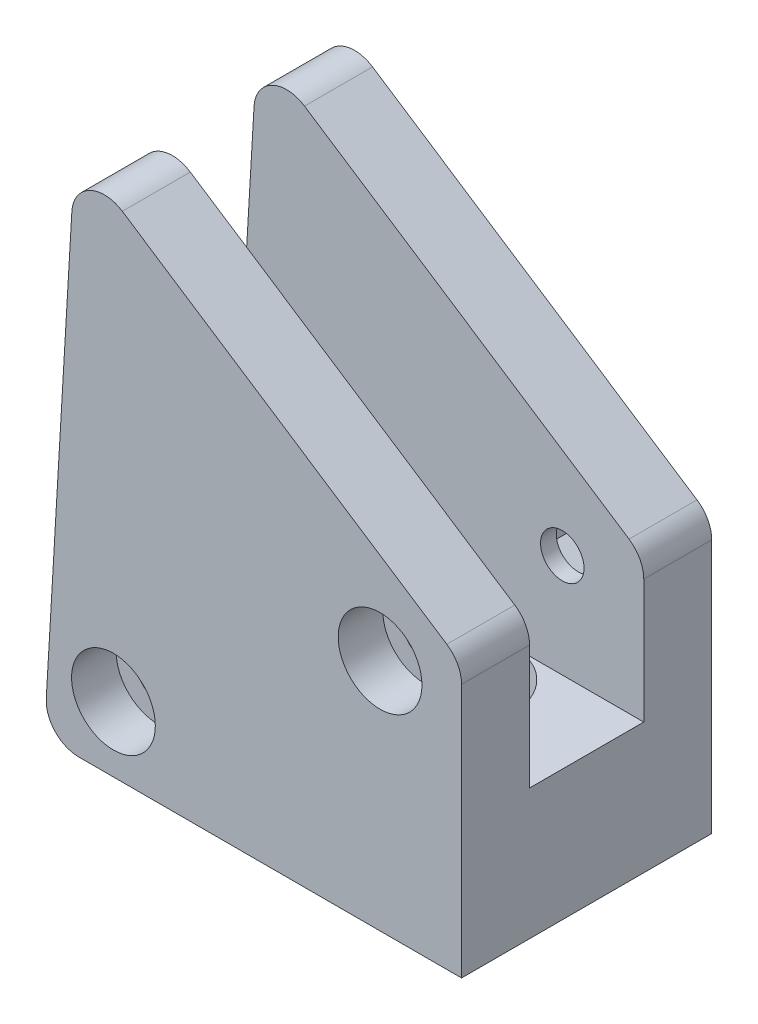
ISO-10303-21;
HEADER;
FILE_DESCRIPTION(('STEP AP214'),'2;1');
FILE_NAME('part.step','',(''),(''),'','','');
FILE_SCHEMA(('AUTOMOTIVE_DESIGN { 1 0 10303 214 1 1 1 1 }'));
ENDSEC;
DATA;
#1=APPLICATION_CONTEXT('core data for automotive mechanical design processes');
#2=APPLICATION_PROTOCOL_DEFINITION('international standard','automotive_design',2000,#1);
#3=PRODUCT_CONTEXT('',#1,'mechanical');
#4=PRODUCT('Part','Part','',(#3));
#5=PRODUCT_RELATED_PRODUCT_CATEGORY('part','',(#4));
#6=PRODUCT_DEFINITION_FORMATION('','',#4);
#7=PRODUCT_DEFINITION_CONTEXT('part definition',#1,'design');
#8=PRODUCT_DEFINITION('design','',#6,#7);
#9=PRODUCT_DEFINITION_SHAPE('','',#8);
#10=(LENGTH_UNIT() NAMED_UNIT(*) SI_UNIT(.MILLI.,.METRE.));
#11=(NAMED_UNIT(*) PLANE_ANGLE_UNIT() SI_UNIT($,.RADIAN.));
#12=(NAMED_UNIT(*) SI_UNIT($,.STERADIAN.) SOLID_ANGLE_UNIT());
#13=UNCERTAINTY_MEASURE_WITH_UNIT(LENGTH_MEASURE(1.E-05),#10,'distance_accuracy_value','');
#14=(GEOMETRIC_REPRESENTATION_CONTEXT(3) GLOBAL_UNCERTAINTY_ASSIGNED_CONTEXT((#13)) GLOBAL_UNIT_ASSIGNED_CONTEXT((#10,
#11,#12)) REPRESENTATION_CONTEXT('',''));
#15=CARTESIAN_POINT('',(0.,0.,0.));
#16=DIRECTION('',(0.,0.,1.));
#17=DIRECTION('',(1.,0.,0.));
#18=AXIS2_PLACEMENT_3D('',#15,#16,#17);
#19=CARTESIAN_POINT('',(-32.,6.,11.5));
#20=DIRECTION('',(0.,0.,-1.));
#21=DIRECTION('',(-1.,0.,0.));
#22=AXIS2_PLACEMENT_3D('',#19,#20,#21);
#23=CYLINDRICAL_SURFACE('',#22,2.);
#24=CARTESIAN_POINT('',(-32.,6.,-5.25));
#25=DIRECTION('',(0.,0.,1.));
#26=DIRECTION('',(1.,0.,0.));
#27=AXIS2_PLACEMENT_3D('',#24,#25,#26);
#28=CIRCLE('',#27,2.);
#29=CARTESIAN_POINT('',(-30.,6.,-5.25));
#30=VERTEX_POINT('',#29);
#31=EDGE_CURVE('E471',#30,#30,#28,.T.);
#32=ORIENTED_EDGE('',*,*,#31,.T.);
#33=EDGE_LOOP('',(#32));
#34=FACE_BOUND('',#33,.T.);
#35=CARTESIAN_POINT('',(-32.,6.,-6.7));
#36=DIRECTION('',(0.,0.,-1.));
#37=DIRECTION('',(-1.,0.,0.));
#38=AXIS2_PLACEMENT_3D('',#35,#36,#37);
#39=CIRCLE('',#38,2.);
#40=CARTESIAN_POINT('',(-34.,6.,-6.7));
#41=VERTEX_POINT('',#40);
#42=EDGE_CURVE('E44',#41,#41,#39,.T.);
#43=ORIENTED_EDGE('',*,*,#42,.T.);
#44=EDGE_LOOP('',(#43));
#45=FACE_BOUND('',#44,.T.);
#46=ADVANCED_FACE('F40',(#34,#45),#23,.F.);
#47=CARTESIAN_POINT('',(-7.48979804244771,21.5,11.5));
#48=DIRECTION('',(0.,0.,-1.));
#49=DIRECTION('',(-1.,0.,0.));
#50=AXIS2_PLACEMENT_3D('',#47,#48,#49);
#51=CYLINDRICAL_SURFACE('',#50,2.);
#52=CARTESIAN_POINT('',(-7.48979804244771,21.5,-5.25));
#53=DIRECTION('',(0.,0.,1.));
#54=DIRECTION('',(1.,0.,0.));
#55=AXIS2_PLACEMENT_3D('',#52,#53,#54);
#56=CIRCLE('',#55,2.);
#57=CARTESIAN_POINT('',(-5.48979804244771,21.5,-5.25));
#58=VERTEX_POINT('',#57);
#59=EDGE_CURVE('E470',#58,#58,#56,.T.);
#60=ORIENTED_EDGE('',*,*,#59,.T.);
#61=EDGE_LOOP('',(#60));
#62=FACE_BOUND('',#61,.T.);
#63=CARTESIAN_POINT('',(-7.48979804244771,21.5,-6.7));
#64=DIRECTION('',(0.,0.,-1.));
#65=DIRECTION('',(-1.,0.,0.));
#66=AXIS2_PLACEMENT_3D('',#63,#64,#65);
#67=CIRCLE('',#66,2.);
#68=CARTESIAN_POINT('',(-9.48979804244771,21.5,-6.7));
#69=VERTEX_POINT('',#68);
#70=EDGE_CURVE('E301',#69,#69,#67,.T.);
#71=ORIENTED_EDGE('',*,*,#70,.T.);
#72=EDGE_LOOP('',(#71));
#73=FACE_BOUND('',#72,.T.);
#74=ADVANCED_FACE('F710',(#62,#73),#51,.F.);
#75=CARTESIAN_POINT('',(-32.,6.,5.25));
#76=DIRECTION('',(0.,0.,1.));
#77=DIRECTION('',(1.,0.,0.));
#78=AXIS2_PLACEMENT_3D('',#75,#76,#77);
#79=CIRCLE('',#78,2.);
#80=CARTESIAN_POINT('',(-30.,6.,5.25));
#81=VERTEX_POINT('',#80);
#82=EDGE_CURVE('E439',#81,#81,#79,.T.);
#83=ORIENTED_EDGE('',*,*,#82,.F.);
#84=EDGE_LOOP('',(#83));
#85=FACE_BOUND('',#84,.T.);
#86=CARTESIAN_POINT('',(-32.,6.,7.4));
#87=DIRECTION('',(0.,0.,1.));
#88=DIRECTION('',(1.,0.,0.));
#89=AXIS2_PLACEMENT_3D('',#86,#87,#88);
#90=CIRCLE('',#89,2.);
#91=CARTESIAN_POINT('',(-30.,6.,7.4));
#92=VERTEX_POINT('',#91);
#93=EDGE_CURVE('E398',#92,#92,#90,.T.);
#94=ORIENTED_EDGE('',*,*,#93,.T.);
#95=EDGE_LOOP('',(#94));
#96=FACE_BOUND('',#95,.T.);
#97=ADVANCED_FACE('F713',(#85,#96),#23,.F.);
#98=CARTESIAN_POINT('',(-7.48979804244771,21.5,5.25));
#99=DIRECTION('',(0.,0.,1.));
#100=DIRECTION('',(1.,0.,0.));
#101=AXIS2_PLACEMENT_3D('',#98,#99,#100);
#102=CIRCLE('',#101,2.);
#103=CARTESIAN_POINT('',(-5.48979804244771,21.5,5.25));
#104=VERTEX_POINT('',#103);
#105=EDGE_CURVE('E428',#104,#104,#102,.T.);
#106=ORIENTED_EDGE('',*,*,#105,.F.);
#107=EDGE_LOOP('',(#106));
#108=FACE_BOUND('',#107,.T.);
#109=CARTESIAN_POINT('',(-7.48979804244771,21.5,7.4));
#110=DIRECTION('',(0.,0.,1.));
#111=DIRECTION('',(1.,0.,0.));
#112=AXIS2_PLACEMENT_3D('',#109,#110,#111);
#113=CIRCLE('',#112,2.);
#114=CARTESIAN_POINT('',(-5.48979804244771,21.5,7.4));
#115=VERTEX_POINT('',#114);
#116=EDGE_CURVE('E380',#115,#115,#113,.T.);
#117=ORIENTED_EDGE('',*,*,#116,.T.);
#118=EDGE_LOOP('',(#117));
#119=FACE_BOUND('',#118,.T.);
#120=ADVANCED_FACE('F719',(#108,#119),#51,.F.);
#121=CARTESIAN_POINT('',(0.,12.,-5.25));
#122=DIRECTION('',(0.,1.,0.));
#123=DIRECTION('',(-1.,0.,0.));
#124=AXIS2_PLACEMENT_3D('',#121,#122,#123);
#125=PLANE('',#124);
#126=CARTESIAN_POINT('',(-12.,12.,0.));
#127=DIRECTION('',(0.,1.,0.));
#128=DIRECTION('',(-1.,0.,0.));
#129=AXIS2_PLACEMENT_3D('',#126,#127,#128);
#130=CIRCLE('',#129,5.25);
#131=CARTESIAN_POINT('',(-12.,12.,5.25));
#132=VERTEX_POINT('',#131);
#133=CARTESIAN_POINT('',(-12.,12.,-5.25));
#134=VERTEX_POINT('',#133);
#135=EDGE_CURVE('E12',#132,#134,#130,.T.);
#136=ORIENTED_EDGE('',*,*,#135,.F.);
#137=DIRECTION('',(-1.,0.,0.));
#138=VECTOR('',#137,1.);
#139=CARTESIAN_POINT('',(0.,12.,5.25));
#140=LINE('',#139,#138);
#141=CARTESIAN_POINT('',(0.,12.,5.25));
#142=VERTEX_POINT('',#141);
#143=EDGE_CURVE('E413',#142,#132,#140,.T.);
#144=ORIENTED_EDGE('',*,*,#143,.F.);
#145=DIRECTION('',(0.,0.,1.));
#146=VECTOR('',#145,1.);
#147=CARTESIAN_POINT('',(0.,12.,-5.25));
#148=LINE('',#147,#146);
#149=CARTESIAN_POINT('',(0.,12.,-5.25));
#150=VERTEX_POINT('',#149);
#151=EDGE_CURVE('E412',#150,#142,#148,.T.);
#152=ORIENTED_EDGE('',*,*,#151,.F.);
#153=DIRECTION('',(-1.,0.,0.));
#154=VECTOR('',#153,1.);
#155=CARTESIAN_POINT('',(0.,12.,-5.25));
#156=LINE('',#155,#154);
#157=EDGE_CURVE('E399',#150,#134,#156,.T.);
#158=ORIENTED_EDGE('',*,*,#157,.T.);
#159=EDGE_LOOP('',(#136,#144,#152,#158));
#160=FACE_BOUND('',#159,.T.);
#161=ADVANCED_FACE('F726',(#160),#125,.T.);
#162=CARTESIAN_POINT('',(0.,0.,11.5));
#163=DIRECTION('',(-1.,0.,0.));
#164=DIRECTION('',(0.,0.,1.));
#165=AXIS2_PLACEMENT_3D('',#162,#163,#164);
#166=PLANE('',#165);
#167=DIRECTION('',(0.,0.,-1.));
#168=VECTOR('',#167,1.);
#169=CARTESIAN_POINT('',(0.,0.,11.5));
#170=LINE('',#169,#168);
#171=CARTESIAN_POINT('',(0.,0.,11.5));
#172=VERTEX_POINT('',#171);
#173=CARTESIAN_POINT('',(0.,0.,-11.5));
#174=VERTEX_POINT('',#173);
#175=EDGE_CURVE('E576',#172,#174,#170,.T.);
#176=ORIENTED_EDGE('',*,*,#175,.T.);
#177=DIRECTION('',(0.,1.,0.));
#178=VECTOR('',#177,1.);
#179=CARTESIAN_POINT('',(0.,0.,-11.5));
#180=LINE('',#179,#178);
#181=CARTESIAN_POINT('',(0.,23.3795369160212,-11.5));
#182=VERTEX_POINT('',#181);
#183=EDGE_CURVE('E524',#174,#182,#180,.T.);
#184=ORIENTED_EDGE('',*,*,#183,.T.);
#185=DIRECTION('',(0.,0.,-1.));
#186=VECTOR('',#185,1.);
#187=CARTESIAN_POINT('',(0.,23.3795369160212,11.5));
#188=LINE('',#187,#186);
#189=CARTESIAN_POINT('',(0.,23.3795369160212,-5.25));
#190=VERTEX_POINT('',#189);
#191=EDGE_CURVE('E571',#190,#182,#188,.T.);
#192=ORIENTED_EDGE('',*,*,#191,.F.);
#193=DIRECTION('',(0.,1.,0.));
#194=VECTOR('',#193,1.);
#195=CARTESIAN_POINT('',(0.,0.,-5.25));
#196=LINE('',#195,#194);
#197=EDGE_CURVE('E490',#150,#190,#196,.T.);
#198=ORIENTED_EDGE('',*,*,#197,.F.);
#199=ORIENTED_EDGE('',*,*,#151,.T.);
#200=DIRECTION('',(0.,1.,0.));
#201=VECTOR('',#200,1.);
#202=CARTESIAN_POINT('',(0.,0.,5.25));
#203=LINE('',#202,#201);
#204=CARTESIAN_POINT('',(0.,23.3795369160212,5.25));
#205=VERTEX_POINT('',#204);
#206=EDGE_CURVE('E462',#142,#205,#203,.T.);
#207=ORIENTED_EDGE('',*,*,#206,.T.);
#208=CARTESIAN_POINT('',(0.,23.3795369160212,11.5));
#209=VERTEX_POINT('',#208);
#210=EDGE_CURVE('E572',#209,#205,#188,.T.);
#211=ORIENTED_EDGE('',*,*,#210,.F.);
#212=DIRECTION('',(0.,1.,0.));
#213=VECTOR('',#212,1.);
#214=CARTESIAN_POINT('',(0.,0.,11.5));
#215=LINE('',#214,#213);
#216=EDGE_CURVE('E501',#172,#209,#215,.T.);
#217=ORIENTED_EDGE('',*,*,#216,.F.);
#218=EDGE_LOOP('',(#176,#184,#192,#198,#199,#207,#211,#217));
#219=FACE_BOUND('',#218,.T.);
#220=ADVANCED_FACE('F673',(#219),#166,.F.);
#221=CARTESIAN_POINT('',(-3.,23.3795369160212,11.5));
#222=DIRECTION('',(0.,0.,-1.));
#223=DIRECTION('',(-1.,0.,0.));
#224=AXIS2_PLACEMENT_3D('',#221,#222,#223);
#225=CYLINDRICAL_SURFACE('',#224,3.);
#226=CARTESIAN_POINT('',(-3.,23.3795369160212,-5.25));
#227=DIRECTION('',(0.,0.,1.));
#228=DIRECTION('',(1.,0.,0.));
#229=AXIS2_PLACEMENT_3D('',#226,#227,#228);
#230=CIRCLE('',#229,3.);
#231=CARTESIAN_POINT('',(-1.35519854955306,25.8884466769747,-5.25));
#232=VERTEX_POINT('',#231);
#233=EDGE_CURVE('E487',#190,#232,#230,.T.);
#234=ORIENTED_EDGE('',*,*,#233,.F.);
#235=ORIENTED_EDGE('',*,*,#191,.T.);
#236=CARTESIAN_POINT('',(-3.,23.3795369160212,-11.5));
#237=DIRECTION('',(0.,0.,1.));
#238=DIRECTION('',(1.,0.,0.));
#239=AXIS2_PLACEMENT_3D('',#236,#237,#238);
#240=CIRCLE('',#239,3.);
#241=CARTESIAN_POINT('',(-1.35519854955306,25.8884466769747,-11.5));
#242=VERTEX_POINT('',#241);
#243=EDGE_CURVE('E528',#182,#242,#240,.T.);
#244=ORIENTED_EDGE('',*,*,#243,.T.);
#245=DIRECTION('',(0.,0.,-1.));
#246=VECTOR('',#245,1.);
#247=CARTESIAN_POINT('',(-1.35519854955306,25.8884466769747,11.5));
#248=LINE('',#247,#246);
#249=EDGE_CURVE('E566',#232,#242,#248,.T.);
#250=ORIENTED_EDGE('',*,*,#249,.F.);
#251=EDGE_LOOP('',(#234,#235,#244,#250));
#252=FACE_BOUND('',#251,.T.);
#253=ADVANCED_FACE('F668',(#252),#225,.T.);
#254=CARTESIAN_POINT('',(-1.35519854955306,25.8884466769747,11.5));
#255=DIRECTION('',(-0.548267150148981,-0.836303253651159,0.));
#256=DIRECTION('',(0.836303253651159,-0.548267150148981,0.));
#257=AXIS2_PLACEMENT_3D('',#254,#255,#256);
#258=PLANE('',#257);
#259=DIRECTION('',(-0.836303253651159,0.548267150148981,0.));
#260=VECTOR('',#259,1.);
#261=CARTESIAN_POINT('',(-1.35519854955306,25.8884466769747,-5.25));
#262=LINE('',#261,#260);
#263=CARTESIAN_POINT('',(-31.1839969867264,45.4437338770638,-5.25));
#264=VERTEX_POINT('',#263);
#265=EDGE_CURVE('E484',#232,#264,#262,.T.);
#266=ORIENTED_EDGE('',*,*,#265,.F.);
#267=ORIENTED_EDGE('',*,*,#249,.T.);
#268=DIRECTION('',(-0.836303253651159,0.548267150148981,0.));
#269=VECTOR('',#268,1.);
#270=CARTESIAN_POINT('',(-1.35519854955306,25.8884466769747,-11.5));
#271=LINE('',#270,#269);
#272=CARTESIAN_POINT('',(-31.1839969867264,45.4437338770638,-11.5));
#273=VERTEX_POINT('',#272);
#274=EDGE_CURVE('E532',#242,#273,#271,.T.);
#275=ORIENTED_EDGE('',*,*,#274,.T.);
#276=DIRECTION('',(0.,0.,-1.));
#277=VECTOR('',#276,1.);
#278=CARTESIAN_POINT('',(-31.1839969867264,45.4437338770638,11.5));
#279=LINE('',#278,#277);
#280=EDGE_CURVE('E561',#264,#273,#279,.T.);
#281=ORIENTED_EDGE('',*,*,#280,.F.);
#282=EDGE_LOOP('',(#266,#267,#275,#281));
#283=FACE_BOUND('',#282,.T.);
#284=ADVANCED_FACE('F663',(#283),#258,.F.);
#285=CARTESIAN_POINT('',(-32.8287984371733,42.9348241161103,11.5));
#286=DIRECTION('',(0.,0.,-1.));
#287=DIRECTION('',(-1.,0.,0.));
#288=AXIS2_PLACEMENT_3D('',#285,#286,#287);
#289=CYLINDRICAL_SURFACE('',#288,3.);
#290=CARTESIAN_POINT('',(-32.8287984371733,42.9348241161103,-5.25));
#291=DIRECTION('',(0.,0.,1.));
#292=DIRECTION('',(1.,0.,0.));
#293=AXIS2_PLACEMENT_3D('',#290,#291,#292);
#294=CIRCLE('',#293,3.);
#295=CARTESIAN_POINT('',(-35.8236036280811,43.1112947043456,-5.25));
#296=VERTEX_POINT('',#295);
#297=EDGE_CURVE('E481',#264,#296,#294,.T.);
#298=ORIENTED_EDGE('',*,*,#297,.F.);
#299=ORIENTED_EDGE('',*,*,#280,.T.);
#300=CARTESIAN_POINT('',(-32.8287984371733,42.9348241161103,-11.5));
#301=DIRECTION('',(0.,0.,1.));
#302=DIRECTION('',(1.,0.,0.));
#303=AXIS2_PLACEMENT_3D('',#300,#301,#302);
#304=CIRCLE('',#303,3.);
#305=CARTESIAN_POINT('',(-35.8236036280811,43.1112947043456,-11.5));
#306=VERTEX_POINT('',#305);
#307=EDGE_CURVE('E536',#273,#306,#304,.T.);
#308=ORIENTED_EDGE('',*,*,#307,.T.);
#309=DIRECTION('',(0.,0.,-1.));
#310=VECTOR('',#309,1.);
#311=CARTESIAN_POINT('',(-35.8236036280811,43.1112947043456,11.5));
#312=LINE('',#311,#310);
#313=EDGE_CURVE('E556',#296,#306,#312,.T.);
#314=ORIENTED_EDGE('',*,*,#313,.F.);
#315=EDGE_LOOP('',(#298,#299,#308,#314));
#316=FACE_BOUND('',#315,.T.);
#317=ADVANCED_FACE('F658',(#316),#289,.T.);
#318=CARTESIAN_POINT('',(-35.8236036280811,43.1112947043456,11.5));
#319=DIRECTION('',(0.998268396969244,-0.0588235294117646,0.));
#320=DIRECTION('',(0.0588235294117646,0.998268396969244,0.));
#321=AXIS2_PLACEMENT_3D('',#318,#319,#320);
#322=PLANE('',#321);
#323=DIRECTION('',(-0.0588235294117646,-0.998268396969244,0.));
#324=VECTOR('',#323,1.);
#325=CARTESIAN_POINT('',(-35.8236036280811,43.1112947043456,-5.25));
#326=LINE('',#325,#324);
#327=CARTESIAN_POINT('',(-38.1767857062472,3.1764705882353,-5.25));
#328=VERTEX_POINT('',#327);
#329=EDGE_CURVE('E478',#296,#328,#326,.T.);
#330=ORIENTED_EDGE('',*,*,#329,.F.);
#331=ORIENTED_EDGE('',*,*,#313,.T.);
#332=DIRECTION('',(-0.0588235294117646,-0.998268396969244,0.));
#333=VECTOR('',#332,1.);
#334=CARTESIAN_POINT('',(-35.8236036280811,43.1112947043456,-11.5));
#335=LINE('',#334,#333);
#336=CARTESIAN_POINT('',(-38.1767857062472,3.1764705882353,-11.5));
#337=VERTEX_POINT('',#336);
#338=EDGE_CURVE('E540',#306,#337,#335,.T.);
#339=ORIENTED_EDGE('',*,*,#338,.T.);
#340=DIRECTION('',(0.,0.,-1.));
#341=VECTOR('',#340,1.);
#342=CARTESIAN_POINT('',(-38.1767857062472,3.1764705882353,11.5));
#343=LINE('',#342,#341);
#344=EDGE_CURVE('E551',#328,#337,#343,.T.);
#345=ORIENTED_EDGE('',*,*,#344,.F.);
#346=EDGE_LOOP('',(#330,#331,#339,#345));
#347=FACE_BOUND('',#346,.T.);
#348=ADVANCED_FACE('F652',(#347),#322,.F.);
#349=CARTESIAN_POINT('',(-35.1819805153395,3.,11.5));
#350=DIRECTION('',(0.,0.,-1.));
#351=DIRECTION('',(-1.,0.,0.));
#352=AXIS2_PLACEMENT_3D('',#349,#350,#351);
#353=CYLINDRICAL_SURFACE('',#352,3.);
#354=CARTESIAN_POINT('',(-35.1819805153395,3.,-5.25));
#355=DIRECTION('',(0.,0.,1.));
#356=DIRECTION('',(1.,0.,0.));
#357=AXIS2_PLACEMENT_3D('',#354,#355,#356);
#358=CIRCLE('',#357,3.);
#359=CARTESIAN_POINT('',(-35.1819805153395,0.,-5.25));
#360=VERTEX_POINT('',#359);
#361=EDGE_CURVE('E475',#328,#360,#358,.T.);
#362=ORIENTED_EDGE('',*,*,#361,.F.);
#363=ORIENTED_EDGE('',*,*,#344,.T.);
#364=CARTESIAN_POINT('',(-35.1819805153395,3.,-11.5));
#365=DIRECTION('',(0.,0.,1.));
#366=DIRECTION('',(1.,0.,0.));
#367=AXIS2_PLACEMENT_3D('',#364,#365,#366);
#368=CIRCLE('',#367,3.);
#369=CARTESIAN_POINT('',(-35.1819805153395,0.,-11.5));
#370=VERTEX_POINT('',#369);
#371=EDGE_CURVE('E502',#337,#370,#368,.T.);
#372=ORIENTED_EDGE('',*,*,#371,.T.);
#373=DIRECTION('',(0.,0.,-1.));
#374=VECTOR('',#373,1.);
#375=CARTESIAN_POINT('',(-35.1819805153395,0.,11.5));
#376=LINE('',#375,#374);
#377=EDGE_CURVE('E520',#360,#370,#376,.T.);
#378=ORIENTED_EDGE('',*,*,#377,.F.);
#379=EDGE_LOOP('',(#362,#363,#372,#378));
#380=FACE_BOUND('',#379,.T.);
#381=ADVANCED_FACE('F647',(#380),#353,.T.);
#382=CARTESIAN_POINT('',(-3.,23.3795369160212,11.5));
#383=DIRECTION('',(0.,0.,1.));
#384=DIRECTION('',(1.,0.,0.));
#385=AXIS2_PLACEMENT_3D('',#382,#383,#384);
#386=PLANE('',#385);
#387=CARTESIAN_POINT('',(-32.,6.,11.5));
#388=DIRECTION('',(0.,0.,1.));
#389=DIRECTION('',(1.,0.,0.));
#390=AXIS2_PLACEMENT_3D('',#387,#388,#389);
#391=CIRCLE('',#390,3.85);
#392=CARTESIAN_POINT('',(-28.15,6.,11.5));
#393=VERTEX_POINT('',#392);
#394=EDGE_CURVE('E381',#393,#393,#391,.T.);
#395=ORIENTED_EDGE('',*,*,#394,.F.);
#396=EDGE_LOOP('',(#395));
#397=FACE_BOUND('',#396,.T.);
#398=CARTESIAN_POINT('',(-7.48979804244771,21.5,11.5));
#399=DIRECTION('',(0.,0.,1.));
#400=DIRECTION('',(1.,0.,0.));
#401=AXIS2_PLACEMENT_3D('',#398,#399,#400);
#402=CIRCLE('',#401,3.85);
#403=CARTESIAN_POINT('',(-3.63979804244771,21.5,11.5));
#404=VERTEX_POINT('',#403);
#405=EDGE_CURVE('E389',#404,#404,#402,.T.);
#406=ORIENTED_EDGE('',*,*,#405,.F.);
#407=EDGE_LOOP('',(#406));
#408=FACE_BOUND('',#407,.T.);
#409=DIRECTION('',(1.,0.,0.));
#410=VECTOR('',#409,1.);
#411=CARTESIAN_POINT('',(-35.1819805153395,0.,11.5));
#412=LINE('',#411,#410);
#413=CARTESIAN_POINT('',(-35.1819805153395,0.,11.5));
#414=VERTEX_POINT('',#413);
#415=EDGE_CURVE('E497',#414,#172,#412,.T.);
#416=ORIENTED_EDGE('',*,*,#415,.T.);
#417=ORIENTED_EDGE('',*,*,#216,.T.);
#418=CARTESIAN_POINT('',(-3.,23.3795369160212,11.5));
#419=DIRECTION('',(0.,0.,1.));
#420=DIRECTION('',(1.,0.,0.));
#421=AXIS2_PLACEMENT_3D('',#418,#419,#420);
#422=CIRCLE('',#421,3.);
#423=CARTESIAN_POINT('',(-1.35519854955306,25.8884466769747,11.5));
#424=VERTEX_POINT('',#423);
#425=EDGE_CURVE('E505',#209,#424,#422,.T.);
#426=ORIENTED_EDGE('',*,*,#425,.T.);
#427=DIRECTION('',(-0.836303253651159,0.548267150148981,0.));
#428=VECTOR('',#427,1.);
#429=CARTESIAN_POINT('',(-1.35519854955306,25.8884466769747,11.5));
#430=LINE('',#429,#428);
#431=CARTESIAN_POINT('',(-31.1839969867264,45.4437338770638,11.5));
#432=VERTEX_POINT('',#431);
#433=EDGE_CURVE('E508',#424,#432,#430,.T.);
#434=ORIENTED_EDGE('',*,*,#433,.T.);
#435=CARTESIAN_POINT('',(-32.8287984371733,42.9348241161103,11.5));
#436=DIRECTION('',(0.,0.,1.));
#437=DIRECTION('',(1.,0.,0.));
#438=AXIS2_PLACEMENT_3D('',#435,#436,#437);
#439=CIRCLE('',#438,3.);
#440=CARTESIAN_POINT('',(-35.8236036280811,43.1112947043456,11.5));
#441=VERTEX_POINT('',#440);
#442=EDGE_CURVE('E511',#432,#441,#439,.T.);
#443=ORIENTED_EDGE('',*,*,#442,.T.);
#444=DIRECTION('',(-0.0588235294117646,-0.998268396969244,0.));
#445=VECTOR('',#444,1.);
#446=CARTESIAN_POINT('',(-35.8236036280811,43.1112947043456,11.5));
#447=LINE('',#446,#445);
#448=CARTESIAN_POINT('',(-38.1767857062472,3.1764705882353,11.5));
#449=VERTEX_POINT('',#448);
#450=EDGE_CURVE('E514',#441,#449,#447,.T.);
#451=ORIENTED_EDGE('',*,*,#450,.T.);
#452=CARTESIAN_POINT('',(-35.1819805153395,3.,11.5));
#453=DIRECTION('',(0.,0.,1.));
#454=DIRECTION('',(1.,0.,0.));
#455=AXIS2_PLACEMENT_3D('',#452,#453,#454);
#456=CIRCLE('',#455,3.);
#457=EDGE_CURVE('E517',#449,#414,#456,.T.);
#458=ORIENTED_EDGE('',*,*,#457,.T.);
#459=EDGE_LOOP('',(#416,#417,#426,#434,#443,#451,#458));
#460=FACE_BOUND('',#459,.T.);
#461=ADVANCED_FACE('F630',(#397,#408,#460),#386,.T.);
#462=CARTESIAN_POINT('',(-3.,23.3795369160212,-11.5));
#463=DIRECTION('',(0.,0.,1.));
#464=DIRECTION('',(1.,0.,0.));
#465=AXIS2_PLACEMENT_3D('',#462,#463,#464);
#466=PLANE('',#465);
#467=DIRECTION('',(0.868272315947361,-0.496087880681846,0.));
#468=VECTOR('',#467,1.);
#469=CARTESIAN_POINT('',(-7.50959366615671,25.8878173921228,-11.5));
#470=LINE('',#469,#468);
#471=CARTESIAN_POINT('',(-7.50959366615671,25.8878173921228,-11.5));
#472=VERTEX_POINT('',#471);
#473=CARTESIAN_POINT('',(-3.69973452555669,23.7110522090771,-11.5));
#474=VERTEX_POINT('',#473);
#475=EDGE_CURVE('E283',#472,#474,#470,.T.);
#476=ORIENTED_EDGE('',*,*,#475,.F.);
#477=DIRECTION('',(0.863760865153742,0.503901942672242,0.));
#478=VECTOR('',#477,1.);
#479=CARTESIAN_POINT('',(-11.2996571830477,23.6767651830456,-11.5));
#480=LINE('',#479,#478);
#481=CARTESIAN_POINT('',(-11.2996571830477,23.6767651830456,-11.5));
#482=VERTEX_POINT('',#481);
#483=EDGE_CURVE('E58',#482,#472,#480,.T.);
#484=ORIENTED_EDGE('',*,*,#483,.F.);
#485=DIRECTION('',(-0.00451145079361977,0.999989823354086,0.));
#486=VECTOR('',#485,1.);
#487=CARTESIAN_POINT('',(-11.2798615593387,19.2889477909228,-11.5));
#488=LINE('',#487,#486);
#489=CARTESIAN_POINT('',(-11.2798615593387,19.2889477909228,-11.5));
#490=VERTEX_POINT('',#489);
#491=EDGE_CURVE('E263',#490,#482,#488,.T.);
#492=ORIENTED_EDGE('',*,*,#491,.F.);
#493=DIRECTION('',(-0.868272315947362,0.496087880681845,0.));
#494=VECTOR('',#493,1.);
#495=CARTESIAN_POINT('',(-7.47000241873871,17.1121826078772,-11.5));
#496=LINE('',#495,#494);
#497=CARTESIAN_POINT('',(-7.47000241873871,17.1121826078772,-11.5));
#498=VERTEX_POINT('',#497);
#499=EDGE_CURVE('E267',#498,#490,#496,.T.);
#500=ORIENTED_EDGE('',*,*,#499,.F.);
#501=DIRECTION('',(-0.863760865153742,-0.503901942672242,0.));
#502=VECTOR('',#501,1.);
#503=CARTESIAN_POINT('',(-3.67993890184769,19.3232348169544,-11.5));
#504=LINE('',#503,#502);
#505=CARTESIAN_POINT('',(-3.67993890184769,19.3232348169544,-11.5));
#506=VERTEX_POINT('',#505);
#507=EDGE_CURVE('E291',#506,#498,#504,.T.);
#508=ORIENTED_EDGE('',*,*,#507,.F.);
#509=DIRECTION('',(0.00451145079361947,-0.999989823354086,0.));
#510=VECTOR('',#509,1.);
#511=CARTESIAN_POINT('',(-3.69973452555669,23.7110522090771,-11.5));
#512=LINE('',#511,#510);
#513=EDGE_CURVE('E287',#474,#506,#512,.T.);
#514=ORIENTED_EDGE('',*,*,#513,.F.);
#515=EDGE_LOOP('',(#476,#484,#492,#500,#508,#514));
#516=FACE_BOUND('',#515,.T.);
#517=DIRECTION('',(0.866025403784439,-0.499999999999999,0.));
#518=VECTOR('',#517,1.);
#519=CARTESIAN_POINT('',(-32.,10.3878620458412,-11.5));
#520=LINE('',#519,#518);
#521=CARTESIAN_POINT('',(-32.,10.3878620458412,-11.5));
#522=VERTEX_POINT('',#521);
#523=CARTESIAN_POINT('',(-28.2,8.19393102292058,-11.5));
#524=VERTEX_POINT('',#523);
#525=EDGE_CURVE('E341',#522,#524,#520,.T.);
#526=ORIENTED_EDGE('',*,*,#525,.F.);
#527=DIRECTION('',(0.866025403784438,0.500000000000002,0.));
#528=VECTOR('',#527,1.);
#529=CARTESIAN_POINT('',(-35.8,8.19393102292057,-11.5));
#530=LINE('',#529,#528);
#531=CARTESIAN_POINT('',(-35.8,8.19393102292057,-11.5));
#532=VERTEX_POINT('',#531);
#533=EDGE_CURVE('E66',#532,#522,#530,.T.);
#534=ORIENTED_EDGE('',*,*,#533,.F.);
#535=DIRECTION('',(0.,1.,0.));
#536=VECTOR('',#535,1.);
#537=CARTESIAN_POINT('',(-35.8,3.80606897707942,-11.5));
#538=LINE('',#537,#536);
#539=CARTESIAN_POINT('',(-35.8,3.80606897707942,-11.5));
#540=VERTEX_POINT('',#539);
#541=EDGE_CURVE('E318',#540,#532,#538,.T.);
#542=ORIENTED_EDGE('',*,*,#541,.F.);
#543=DIRECTION('',(-0.866025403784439,0.5,0.));
#544=VECTOR('',#543,1.);
#545=CARTESIAN_POINT('',(-32.,1.61213795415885,-11.5));
#546=LINE('',#545,#544);
#547=CARTESIAN_POINT('',(-32.,1.61213795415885,-11.5));
#548=VERTEX_POINT('',#547);
#549=EDGE_CURVE('E353',#548,#540,#546,.T.);
#550=ORIENTED_EDGE('',*,*,#549,.F.);
#551=DIRECTION('',(-0.866025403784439,-0.5,0.));
#552=VECTOR('',#551,1.);
#553=CARTESIAN_POINT('',(-28.2,3.80606897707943,-11.5));
#554=LINE('',#553,#552);
#555=CARTESIAN_POINT('',(-28.2,3.80606897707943,-11.5));
#556=VERTEX_POINT('',#555);
#557=EDGE_CURVE('E349',#556,#548,#554,.T.);
#558=ORIENTED_EDGE('',*,*,#557,.F.);
#559=DIRECTION('',(0.,-1.,0.));
#560=VECTOR('',#559,1.);
#561=CARTESIAN_POINT('',(-28.2,8.19393102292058,-11.5));
#562=LINE('',#561,#560);
#563=EDGE_CURVE('E345',#524,#556,#562,.T.);
#564=ORIENTED_EDGE('',*,*,#563,.F.);
#565=EDGE_LOOP('',(#526,#534,#542,#550,#558,#564));
#566=FACE_BOUND('',#565,.T.);
#567=DIRECTION('',(1.,0.,0.));
#568=VECTOR('',#567,1.);
#569=CARTESIAN_POINT('',(-35.1819805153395,0.,-11.5));
#570=LINE('',#569,#568);
#571=EDGE_CURVE('E496',#370,#174,#570,.T.);
#572=ORIENTED_EDGE('',*,*,#571,.F.);
#573=ORIENTED_EDGE('',*,*,#371,.F.);
#574=ORIENTED_EDGE('',*,*,#338,.F.);
#575=ORIENTED_EDGE('',*,*,#307,.F.);
#576=ORIENTED_EDGE('',*,*,#274,.F.);
#577=ORIENTED_EDGE('',*,*,#243,.F.);
#578=ORIENTED_EDGE('',*,*,#183,.F.);
#579=EDGE_LOOP('',(#572,#573,#574,#575,#576,#577,#578));
#580=FACE_BOUND('',#579,.T.);
#581=ADVANCED_FACE('F627',(#516,#566,#580),#466,.F.);
#582=CARTESIAN_POINT('',(-35.1819805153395,0.,11.5));
#583=DIRECTION('',(0.,1.,0.));
#584=DIRECTION('',(0.,0.,1.));
#585=AXIS2_PLACEMENT_3D('',#582,#583,#584);
#586=PLANE('',#585);
#587=CARTESIAN_POINT('',(-12.,0.,0.));
#588=DIRECTION('',(0.,-1.,0.));
#589=DIRECTION('',(0.,0.,-1.));
#590=AXIS2_PLACEMENT_3D('',#587,#588,#589);
#591=CIRCLE('',#590,5.25);
#592=CARTESIAN_POINT('',(-12.,0.,-5.25));
#593=VERTEX_POINT('',#592);
#594=EDGE_CURVE('E393',#593,#593,#591,.T.);
#595=ORIENTED_EDGE('',*,*,#594,.F.);
#596=EDGE_LOOP('',(#595));
#597=FACE_BOUND('',#596,.T.);
#598=DIRECTION('',(0.,0.,1.));
#599=VECTOR('',#598,1.);
#600=CARTESIAN_POINT('',(-24.,0.,-5.25));
#601=LINE('',#600,#599);
#602=CARTESIAN_POINT('',(-24.,0.,-5.25));
#603=VERTEX_POINT('',#602);
#604=CARTESIAN_POINT('',(-24.,0.,5.25));
#605=VERTEX_POINT('',#604);
#606=EDGE_CURVE('E425',#603,#605,#601,.T.);
#607=ORIENTED_EDGE('',*,*,#606,.F.);
#608=DIRECTION('',(1.,0.,0.));
#609=VECTOR('',#608,1.);
#610=CARTESIAN_POINT('',(-35.1819805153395,0.,-5.25));
#611=LINE('',#610,#609);
#612=EDGE_CURVE('E493',#360,#603,#611,.T.);
#613=ORIENTED_EDGE('',*,*,#612,.F.);
#614=ORIENTED_EDGE('',*,*,#377,.T.);
#615=ORIENTED_EDGE('',*,*,#571,.T.);
#616=ORIENTED_EDGE('',*,*,#175,.F.);
#617=ORIENTED_EDGE('',*,*,#415,.F.);
#618=CARTESIAN_POINT('',(-35.1819805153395,0.,5.25));
#619=VERTEX_POINT('',#618);
#620=EDGE_CURVE('E547',#414,#619,#376,.T.);
#621=ORIENTED_EDGE('',*,*,#620,.T.);
#622=DIRECTION('',(1.,0.,0.));
#623=VECTOR('',#622,1.);
#624=CARTESIAN_POINT('',(-35.1819805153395,0.,5.25));
#625=LINE('',#624,#623);
#626=EDGE_CURVE('E466',#619,#605,#625,.T.);
#627=ORIENTED_EDGE('',*,*,#626,.T.);
#628=EDGE_LOOP('',(#607,#613,#614,#615,#616,#617,#621,#627));
#629=FACE_BOUND('',#628,.T.);
#630=ADVANCED_FACE('F42',(#597,#629),#586,.F.);
#631=ORIENTED_EDGE('',*,*,#210,.T.);
#632=CARTESIAN_POINT('',(-3.,23.3795369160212,5.25));
#633=DIRECTION('',(0.,0.,1.));
#634=DIRECTION('',(1.,0.,0.));
#635=AXIS2_PLACEMENT_3D('',#632,#633,#634);
#636=CIRCLE('',#635,3.);
#637=CARTESIAN_POINT('',(-1.35519854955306,25.8884466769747,5.25));
#638=VERTEX_POINT('',#637);
#639=EDGE_CURVE('E458',#205,#638,#636,.T.);
#640=ORIENTED_EDGE('',*,*,#639,.T.);
#641=EDGE_CURVE('E567',#424,#638,#248,.T.);
#642=ORIENTED_EDGE('',*,*,#641,.F.);
#643=ORIENTED_EDGE('',*,*,#425,.F.);
#644=EDGE_LOOP('',(#631,#640,#642,#643));
#645=FACE_BOUND('',#644,.T.);
#646=ADVANCED_FACE('F697',(#645),#225,.T.);
#647=ORIENTED_EDGE('',*,*,#641,.T.);
#648=DIRECTION('',(-0.836303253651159,0.548267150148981,0.));
#649=VECTOR('',#648,1.);
#650=CARTESIAN_POINT('',(-1.35519854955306,25.8884466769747,5.25));
#651=LINE('',#650,#649);
#652=CARTESIAN_POINT('',(-31.1839969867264,45.4437338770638,5.25));
#653=VERTEX_POINT('',#652);
#654=EDGE_CURVE('E455',#638,#653,#651,.T.);
#655=ORIENTED_EDGE('',*,*,#654,.T.);
#656=EDGE_CURVE('E562',#432,#653,#279,.T.);
#657=ORIENTED_EDGE('',*,*,#656,.F.);
#658=ORIENTED_EDGE('',*,*,#433,.F.);
#659=EDGE_LOOP('',(#647,#655,#657,#658));
#660=FACE_BOUND('',#659,.T.);
#661=ADVANCED_FACE('F699',(#660),#258,.F.);
#662=ORIENTED_EDGE('',*,*,#656,.T.);
#663=CARTESIAN_POINT('',(-32.8287984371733,42.9348241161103,5.25));
#664=DIRECTION('',(0.,0.,1.));
#665=DIRECTION('',(1.,0.,0.));
#666=AXIS2_PLACEMENT_3D('',#663,#664,#665);
#667=CIRCLE('',#666,3.);
#668=CARTESIAN_POINT('',(-35.8236036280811,43.1112947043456,5.25));
#669=VERTEX_POINT('',#668);
#670=EDGE_CURVE('E451',#653,#669,#667,.T.);
#671=ORIENTED_EDGE('',*,*,#670,.T.);
#672=EDGE_CURVE('E557',#441,#669,#312,.T.);
#673=ORIENTED_EDGE('',*,*,#672,.F.);
#674=ORIENTED_EDGE('',*,*,#442,.F.);
#675=EDGE_LOOP('',(#662,#671,#673,#674));
#676=FACE_BOUND('',#675,.T.);
#677=ADVANCED_FACE('F692',(#676),#289,.T.);
#678=ORIENTED_EDGE('',*,*,#672,.T.);
#679=DIRECTION('',(-0.0588235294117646,-0.998268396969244,0.));
#680=VECTOR('',#679,1.);
#681=CARTESIAN_POINT('',(-35.8236036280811,43.1112947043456,5.25));
#682=LINE('',#681,#680);
#683=CARTESIAN_POINT('',(-38.1767857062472,3.1764705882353,5.25));
#684=VERTEX_POINT('',#683);
#685=EDGE_CURVE('E447',#669,#684,#682,.T.);
#686=ORIENTED_EDGE('',*,*,#685,.T.);
#687=EDGE_CURVE('E552',#449,#684,#343,.T.);
#688=ORIENTED_EDGE('',*,*,#687,.F.);
#689=ORIENTED_EDGE('',*,*,#450,.F.);
#690=EDGE_LOOP('',(#678,#686,#688,#689));
#691=FACE_BOUND('',#690,.T.);
#692=ADVANCED_FACE('F687',(#691),#322,.F.);
#693=ORIENTED_EDGE('',*,*,#687,.T.);
#694=CARTESIAN_POINT('',(-35.1819805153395,3.,5.25));
#695=DIRECTION('',(0.,0.,1.));
#696=DIRECTION('',(1.,0.,0.));
#697=AXIS2_PLACEMENT_3D('',#694,#695,#696);
#698=CIRCLE('',#697,3.);
#699=EDGE_CURVE('E443',#684,#619,#698,.T.);
#700=ORIENTED_EDGE('',*,*,#699,.T.);
#701=ORIENTED_EDGE('',*,*,#620,.F.);
#702=ORIENTED_EDGE('',*,*,#457,.F.);
#703=EDGE_LOOP('',(#693,#700,#701,#702));
#704=FACE_BOUND('',#703,.T.);
#705=ADVANCED_FACE('F680',(#704),#353,.T.);
#706=CARTESIAN_POINT('',(-19.0909902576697,22.9674120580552,-5.25));
#707=DIRECTION('',(0.,0.,1.));
#708=DIRECTION('',(1.,0.,0.));
#709=AXIS2_PLACEMENT_3D('',#706,#707,#708);
#710=PLANE('',#709);
#711=CARTESIAN_POINT('',(-21.,12.,-5.25));
#712=VERTEX_POINT('',#711);
#713=EDGE_CURVE('E404',#134,#712,#156,.T.);
#714=ORIENTED_EDGE('',*,*,#713,.F.);
#715=ORIENTED_EDGE('',*,*,#157,.F.);
#716=ORIENTED_EDGE('',*,*,#197,.T.);
#717=ORIENTED_EDGE('',*,*,#233,.T.);
#718=ORIENTED_EDGE('',*,*,#265,.T.);
#719=ORIENTED_EDGE('',*,*,#297,.T.);
#720=ORIENTED_EDGE('',*,*,#329,.T.);
#721=ORIENTED_EDGE('',*,*,#361,.T.);
#722=ORIENTED_EDGE('',*,*,#612,.T.);
#723=DIRECTION('',(0.,-1.,0.));
#724=VECTOR('',#723,1.);
#725=CARTESIAN_POINT('',(-24.,0.,-5.25));
#726=LINE('',#725,#724);
#727=CARTESIAN_POINT('',(-24.,8.99999999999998,-5.25));
#728=VERTEX_POINT('',#727);
#729=EDGE_CURVE('E408',#728,#603,#726,.T.);
#730=ORIENTED_EDGE('',*,*,#729,.F.);
#731=CARTESIAN_POINT('',(-21.,9.,-5.25));
#732=DIRECTION('',(0.,0.,1.));
#733=DIRECTION('',(1.,0.,0.));
#734=AXIS2_PLACEMENT_3D('',#731,#732,#733);
#735=CIRCLE('',#734,3.);
#736=EDGE_CURVE('E403',#712,#728,#735,.T.);
#737=ORIENTED_EDGE('',*,*,#736,.F.);
#738=EDGE_LOOP('',(#714,#715,#716,#717,#718,#719,#720,#721,#722,#730,#737));
#739=FACE_BOUND('',#738,.T.);
#740=ORIENTED_EDGE('',*,*,#31,.F.);
#741=EDGE_LOOP('',(#740));
#742=FACE_BOUND('',#741,.T.);
#743=ORIENTED_EDGE('',*,*,#59,.F.);
#744=EDGE_LOOP('',(#743));
#745=FACE_BOUND('',#744,.T.);
#746=ADVANCED_FACE('F776',(#739,#742,#745),#710,.T.);
#747=CARTESIAN_POINT('',(-19.0909902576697,22.9674120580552,5.25));
#748=DIRECTION('',(0.,0.,1.));
#749=DIRECTION('',(1.,0.,0.));
#750=AXIS2_PLACEMENT_3D('',#747,#748,#749);
#751=PLANE('',#750);
#752=ORIENTED_EDGE('',*,*,#82,.T.);
#753=EDGE_LOOP('',(#752));
#754=FACE_BOUND('',#753,.T.);
#755=ORIENTED_EDGE('',*,*,#670,.F.);
#756=ORIENTED_EDGE('',*,*,#654,.F.);
#757=ORIENTED_EDGE('',*,*,#639,.F.);
#758=ORIENTED_EDGE('',*,*,#206,.F.);
#759=ORIENTED_EDGE('',*,*,#143,.T.);
#760=CARTESIAN_POINT('',(-21.,12.,5.25));
#761=VERTEX_POINT('',#760);
#762=EDGE_CURVE('E397',#132,#761,#140,.T.);
#763=ORIENTED_EDGE('',*,*,#762,.T.);
#764=CARTESIAN_POINT('',(-21.,9.,5.25));
#765=DIRECTION('',(0.,0.,1.));
#766=DIRECTION('',(1.,0.,0.));
#767=AXIS2_PLACEMENT_3D('',#764,#765,#766);
#768=CIRCLE('',#767,3.);
#769=CARTESIAN_POINT('',(-24.,8.99999999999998,5.25));
#770=VERTEX_POINT('',#769);
#771=EDGE_CURVE('E417',#761,#770,#768,.T.);
#772=ORIENTED_EDGE('',*,*,#771,.T.);
#773=DIRECTION('',(0.,-1.,0.));
#774=VECTOR('',#773,1.);
#775=CARTESIAN_POINT('',(-24.,0.,5.25));
#776=LINE('',#775,#774);
#777=EDGE_CURVE('E421',#770,#605,#776,.T.);
#778=ORIENTED_EDGE('',*,*,#777,.T.);
#779=ORIENTED_EDGE('',*,*,#626,.F.);
#780=ORIENTED_EDGE('',*,*,#699,.F.);
#781=ORIENTED_EDGE('',*,*,#685,.F.);
#782=EDGE_LOOP('',(#755,#756,#757,#758,#759,#763,#772,#778,#779,#780,#781));
#783=FACE_BOUND('',#782,.T.);
#784=ORIENTED_EDGE('',*,*,#105,.T.);
#785=EDGE_LOOP('',(#784));
#786=FACE_BOUND('',#785,.T.);
#787=ADVANCED_FACE('F684',(#754,#783,#786),#751,.F.);
#788=CARTESIAN_POINT('',(-24.,0.,-5.25));
#789=DIRECTION('',(-1.,0.,0.));
#790=DIRECTION('',(0.,0.,1.));
#791=AXIS2_PLACEMENT_3D('',#788,#789,#790);
#792=PLANE('',#791);
#793=ORIENTED_EDGE('',*,*,#777,.F.);
#794=DIRECTION('',(0.,0.,1.));
#795=VECTOR('',#794,1.);
#796=CARTESIAN_POINT('',(-24.,8.99999999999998,-5.25));
#797=LINE('',#796,#795);
#798=EDGE_CURVE('E429',#728,#770,#797,.T.);
#799=ORIENTED_EDGE('',*,*,#798,.F.);
#800=ORIENTED_EDGE('',*,*,#729,.T.);
#801=ORIENTED_EDGE('',*,*,#606,.T.);
#802=EDGE_LOOP('',(#793,#799,#800,#801));
#803=FACE_BOUND('',#802,.T.);
#804=ADVANCED_FACE('F765',(#803),#792,.T.);
#805=CARTESIAN_POINT('',(-21.,9.,-5.25));
#806=DIRECTION('',(0.,0.,1.));
#807=DIRECTION('',(1.,0.,0.));
#808=AXIS2_PLACEMENT_3D('',#805,#806,#807);
#809=CYLINDRICAL_SURFACE('',#808,3.);
#810=ORIENTED_EDGE('',*,*,#771,.F.);
#811=DIRECTION('',(0.,0.,1.));
#812=VECTOR('',#811,1.);
#813=CARTESIAN_POINT('',(-21.,12.,-5.25));
#814=LINE('',#813,#812);
#815=EDGE_CURVE('E432',#712,#761,#814,.T.);
#816=ORIENTED_EDGE('',*,*,#815,.F.);
#817=ORIENTED_EDGE('',*,*,#736,.T.);
#818=ORIENTED_EDGE('',*,*,#798,.T.);
#819=EDGE_LOOP('',(#810,#816,#817,#818));
#820=FACE_BOUND('',#819,.T.);
#821=ADVANCED_FACE('F768',(#820),#809,.T.);
#822=EDGE_CURVE('E50',#134,#132,#130,.T.);
#823=ORIENTED_EDGE('',*,*,#822,.F.);
#824=ORIENTED_EDGE('',*,*,#713,.T.);
#825=ORIENTED_EDGE('',*,*,#815,.T.);
#826=ORIENTED_EDGE('',*,*,#762,.F.);
#827=EDGE_LOOP('',(#823,#824,#825,#826));
#828=FACE_BOUND('',#827,.T.);
#829=ADVANCED_FACE('F760',(#828),#125,.T.);
#830=CARTESIAN_POINT('',(-12.,45.9348241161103,0.));
#831=DIRECTION('',(0.,-1.,0.));
#832=DIRECTION('',(0.,0.,-1.));
#833=AXIS2_PLACEMENT_3D('',#830,#831,#832);
#834=CYLINDRICAL_SURFACE('',#833,5.25);
#835=ORIENTED_EDGE('',*,*,#135,.T.);
#836=ORIENTED_EDGE('',*,*,#822,.T.);
#837=EDGE_LOOP('',(#835,#836));
#838=FACE_BOUND('',#837,.T.);
#839=ORIENTED_EDGE('',*,*,#594,.T.);
#840=EDGE_LOOP('',(#839));
#841=FACE_BOUND('',#840,.T.);
#842=ADVANCED_FACE('F751',(#838,#841),#834,.F.);
#843=CARTESIAN_POINT('',(-7.48979804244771,21.5,7.4));
#844=DIRECTION('',(0.,0.,1.));
#845=DIRECTION('',(1.,0.,0.));
#846=AXIS2_PLACEMENT_3D('',#843,#844,#845);
#847=CYLINDRICAL_SURFACE('',#846,3.85);
#848=CARTESIAN_POINT('',(-7.48979804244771,21.5,7.4));
#849=DIRECTION('',(0.,0.,1.));
#850=DIRECTION('',(1.,0.,0.));
#851=AXIS2_PLACEMENT_3D('',#848,#849,#850);
#852=CIRCLE('',#851,3.85);
#853=CARTESIAN_POINT('',(-3.63979804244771,21.5,7.4));
#854=VERTEX_POINT('',#853);
#855=EDGE_CURVE('E385',#854,#854,#852,.T.);
#856=ORIENTED_EDGE('',*,*,#855,.F.);
#857=EDGE_LOOP('',(#856));
#858=FACE_BOUND('',#857,.T.);
#859=ORIENTED_EDGE('',*,*,#405,.T.);
#860=EDGE_LOOP('',(#859));
#861=FACE_BOUND('',#860,.T.);
#862=ADVANCED_FACE('F749',(#858,#861),#847,.F.);
#863=CARTESIAN_POINT('',(-7.48979804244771,21.5,7.4));
#864=DIRECTION('',(0.,0.,1.));
#865=DIRECTION('',(1.,0.,0.));
#866=AXIS2_PLACEMENT_3D('',#863,#864,#865);
#867=PLANE('',#866);
#868=ORIENTED_EDGE('',*,*,#116,.F.);
#869=EDGE_LOOP('',(#868));
#870=FACE_BOUND('',#869,.T.);
#871=ORIENTED_EDGE('',*,*,#855,.T.);
#872=EDGE_LOOP('',(#871));
#873=FACE_BOUND('',#872,.T.);
#874=ADVANCED_FACE('F741',(#870,#873),#867,.T.);
#875=CARTESIAN_POINT('',(-32.,6.,7.4));
#876=DIRECTION('',(0.,0.,1.));
#877=DIRECTION('',(1.,0.,0.));
#878=AXIS2_PLACEMENT_3D('',#875,#876,#877);
#879=CYLINDRICAL_SURFACE('',#878,3.85);
#880=CARTESIAN_POINT('',(-32.,6.,7.4));
#881=DIRECTION('',(0.,0.,1.));
#882=DIRECTION('',(1.,0.,0.));
#883=AXIS2_PLACEMENT_3D('',#880,#881,#882);
#884=CIRCLE('',#883,3.85);
#885=CARTESIAN_POINT('',(-28.15,6.,7.4));
#886=VERTEX_POINT('',#885);
#887=EDGE_CURVE('E376',#886,#886,#884,.T.);
#888=ORIENTED_EDGE('',*,*,#887,.F.);
#889=EDGE_LOOP('',(#888));
#890=FACE_BOUND('',#889,.T.);
#891=ORIENTED_EDGE('',*,*,#394,.T.);
#892=EDGE_LOOP('',(#891));
#893=FACE_BOUND('',#892,.T.);
#894=ADVANCED_FACE('F735',(#890,#893),#879,.F.);
#895=CARTESIAN_POINT('',(-32.,6.,7.4));
#896=DIRECTION('',(0.,0.,1.));
#897=DIRECTION('',(1.,0.,0.));
#898=AXIS2_PLACEMENT_3D('',#895,#896,#897);
#899=PLANE('',#898);
#900=ORIENTED_EDGE('',*,*,#93,.F.);
#901=EDGE_LOOP('',(#900));
#902=FACE_BOUND('',#901,.T.);
#903=ORIENTED_EDGE('',*,*,#887,.T.);
#904=EDGE_LOOP('',(#903));
#905=FACE_BOUND('',#904,.T.);
#906=ADVANCED_FACE('F732',(#902,#905),#899,.T.);
#907=CARTESIAN_POINT('',(-35.8,8.19393102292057,-6.7));
#908=DIRECTION('',(-0.500000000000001,0.866025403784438,0.));
#909=DIRECTION('',(-0.866025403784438,-0.500000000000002,0.));
#910=AXIS2_PLACEMENT_3D('',#907,#908,#909);
#911=PLANE('',#910);
#912=ORIENTED_EDGE('',*,*,#533,.T.);
#913=DIRECTION('',(0.,0.,-1.));
#914=VECTOR('',#913,1.);
#915=CARTESIAN_POINT('',(-32.,10.3878620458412,-6.7));
#916=LINE('',#915,#914);
#917=CARTESIAN_POINT('',(-32.,10.3878620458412,-6.7));
#918=VERTEX_POINT('',#917);
#919=EDGE_CURVE('E338',#918,#522,#916,.T.);
#920=ORIENTED_EDGE('',*,*,#919,.F.);
#921=DIRECTION('',(0.866025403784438,0.500000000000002,0.));
#922=VECTOR('',#921,1.);
#923=CARTESIAN_POINT('',(-35.8,8.19393102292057,-6.7));
#924=LINE('',#923,#922);
#925=CARTESIAN_POINT('',(-35.8,8.19393102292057,-6.7));
#926=VERTEX_POINT('',#925);
#927=EDGE_CURVE('E313',#926,#918,#924,.T.);
#928=ORIENTED_EDGE('',*,*,#927,.F.);
#929=DIRECTION('',(0.,0.,-1.));
#930=VECTOR('',#929,1.);
#931=CARTESIAN_POINT('',(-35.8,8.19393102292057,-6.7));
#932=LINE('',#931,#930);
#933=EDGE_CURVE('E284',#926,#532,#932,.T.);
#934=ORIENTED_EDGE('',*,*,#933,.T.);
#935=EDGE_LOOP('',(#912,#920,#928,#934));
#936=FACE_BOUND('',#935,.T.);
#937=ADVANCED_FACE('F608',(#936),#911,.F.);
#938=CARTESIAN_POINT('',(-35.8,3.80606897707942,-6.7));
#939=DIRECTION('',(-1.,0.,0.));
#940=DIRECTION('',(0.,0.,1.));
#941=AXIS2_PLACEMENT_3D('',#938,#939,#940);
#942=PLANE('',#941);
#943=ORIENTED_EDGE('',*,*,#541,.T.);
#944=ORIENTED_EDGE('',*,*,#933,.F.);
#945=DIRECTION('',(0.,1.,0.));
#946=VECTOR('',#945,1.);
#947=CARTESIAN_POINT('',(-35.8,3.80606897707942,-6.7));
#948=LINE('',#947,#946);
#949=CARTESIAN_POINT('',(-35.8,3.80606897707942,-6.7));
#950=VERTEX_POINT('',#949);
#951=EDGE_CURVE('E334',#950,#926,#948,.T.);
#952=ORIENTED_EDGE('',*,*,#951,.F.);
#953=DIRECTION('',(0.,0.,-1.));
#954=VECTOR('',#953,1.);
#955=CARTESIAN_POINT('',(-35.8,3.80606897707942,-6.7));
#956=LINE('',#955,#954);
#957=EDGE_CURVE('E362',#950,#540,#956,.T.);
#958=ORIENTED_EDGE('',*,*,#957,.T.);
#959=EDGE_LOOP('',(#943,#944,#952,#958));
#960=FACE_BOUND('',#959,.T.);
#961=ADVANCED_FACE('F625',(#960),#942,.F.);
#962=CARTESIAN_POINT('',(-32.,1.61213795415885,-6.7));
#963=DIRECTION('',(-0.5,-0.866025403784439,0.));
#964=DIRECTION('',(0.866025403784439,-0.5,0.));
#965=AXIS2_PLACEMENT_3D('',#962,#963,#964);
#966=PLANE('',#965);
#967=ORIENTED_EDGE('',*,*,#549,.T.);
#968=ORIENTED_EDGE('',*,*,#957,.F.);
#969=DIRECTION('',(-0.866025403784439,0.5,0.));
#970=VECTOR('',#969,1.);
#971=CARTESIAN_POINT('',(-32.,1.61213795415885,-6.7));
#972=LINE('',#971,#970);
#973=CARTESIAN_POINT('',(-32.,1.61213795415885,-6.7));
#974=VERTEX_POINT('',#973);
#975=EDGE_CURVE('E330',#974,#950,#972,.T.);
#976=ORIENTED_EDGE('',*,*,#975,.F.);
#977=DIRECTION('',(0.,0.,-1.));
#978=VECTOR('',#977,1.);
#979=CARTESIAN_POINT('',(-32.,1.61213795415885,-6.7));
#980=LINE('',#979,#978);
#981=EDGE_CURVE('E365',#974,#548,#980,.T.);
#982=ORIENTED_EDGE('',*,*,#981,.T.);
#983=EDGE_LOOP('',(#967,#968,#976,#982));
#984=FACE_BOUND('',#983,.T.);
#985=ADVANCED_FACE('F622',(#984),#966,.F.);
#986=CARTESIAN_POINT('',(-28.2,3.80606897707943,-6.7));
#987=DIRECTION('',(0.5,-0.866025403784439,0.));
#988=DIRECTION('',(0.866025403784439,0.5,0.));
#989=AXIS2_PLACEMENT_3D('',#986,#987,#988);
#990=PLANE('',#989);
#991=ORIENTED_EDGE('',*,*,#557,.T.);
#992=ORIENTED_EDGE('',*,*,#981,.F.);
#993=DIRECTION('',(-0.866025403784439,-0.5,0.));
#994=VECTOR('',#993,1.);
#995=CARTESIAN_POINT('',(-28.2,3.80606897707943,-6.7));
#996=LINE('',#995,#994);
#997=CARTESIAN_POINT('',(-28.2,3.80606897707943,-6.7));
#998=VERTEX_POINT('',#997);
#999=EDGE_CURVE('E326',#998,#974,#996,.T.);
#1000=ORIENTED_EDGE('',*,*,#999,.F.);
#1001=DIRECTION('',(0.,0.,-1.));
#1002=VECTOR('',#1001,1.);
#1003=CARTESIAN_POINT('',(-28.2,3.80606897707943,-6.7));
#1004=LINE('',#1003,#1002);
#1005=EDGE_CURVE('E368',#998,#556,#1004,.T.);
#1006=ORIENTED_EDGE('',*,*,#1005,.T.);
#1007=EDGE_LOOP('',(#991,#992,#1000,#1006));
#1008=FACE_BOUND('',#1007,.T.);
#1009=ADVANCED_FACE('F618',(#1008),#990,.F.);
#1010=CARTESIAN_POINT('',(-28.2,8.19393102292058,-6.7));
#1011=DIRECTION('',(1.,0.,0.));
#1012=DIRECTION('',(0.,0.,-1.));
#1013=AXIS2_PLACEMENT_3D('',#1010,#1011,#1012);
#1014=PLANE('',#1013);
#1015=ORIENTED_EDGE('',*,*,#563,.T.);
#1016=ORIENTED_EDGE('',*,*,#1005,.F.);
#1017=DIRECTION('',(0.,-1.,0.));
#1018=VECTOR('',#1017,1.);
#1019=CARTESIAN_POINT('',(-28.2,8.19393102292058,-6.7));
#1020=LINE('',#1019,#1018);
#1021=CARTESIAN_POINT('',(-28.2,8.19393102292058,-6.7));
#1022=VERTEX_POINT('',#1021);
#1023=EDGE_CURVE('E322',#1022,#998,#1020,.T.);
#1024=ORIENTED_EDGE('',*,*,#1023,.F.);
#1025=DIRECTION('',(0.,0.,-1.));
#1026=VECTOR('',#1025,1.);
#1027=CARTESIAN_POINT('',(-28.2,8.19393102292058,-6.7));
#1028=LINE('',#1027,#1026);
#1029=EDGE_CURVE('E371',#1022,#524,#1028,.T.);
#1030=ORIENTED_EDGE('',*,*,#1029,.T.);
#1031=EDGE_LOOP('',(#1015,#1016,#1024,#1030));
#1032=FACE_BOUND('',#1031,.T.);
#1033=ADVANCED_FACE('F614',(#1032),#1014,.F.);
#1034=CARTESIAN_POINT('',(-32.,10.3878620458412,-6.7));
#1035=DIRECTION('',(0.499999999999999,0.866025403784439,0.));
#1036=DIRECTION('',(-0.866025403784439,0.499999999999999,0.));
#1037=AXIS2_PLACEMENT_3D('',#1034,#1035,#1036);
#1038=PLANE('',#1037);
#1039=ORIENTED_EDGE('',*,*,#525,.T.);
#1040=ORIENTED_EDGE('',*,*,#1029,.F.);
#1041=DIRECTION('',(0.866025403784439,-0.499999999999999,0.));
#1042=VECTOR('',#1041,1.);
#1043=CARTESIAN_POINT('',(-32.,10.3878620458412,-6.7));
#1044=LINE('',#1043,#1042);
#1045=EDGE_CURVE('E317',#918,#1022,#1044,.T.);
#1046=ORIENTED_EDGE('',*,*,#1045,.F.);
#1047=ORIENTED_EDGE('',*,*,#919,.T.);
#1048=EDGE_LOOP('',(#1039,#1040,#1046,#1047));
#1049=FACE_BOUND('',#1048,.T.);
#1050=ADVANCED_FACE('F603',(#1049),#1038,.F.);
#1051=CARTESIAN_POINT('',(0.,0.,-6.7));
#1052=DIRECTION('',(0.,0.,-1.));
#1053=DIRECTION('',(-1.,0.,0.));
#1054=AXIS2_PLACEMENT_3D('',#1051,#1052,#1053);
#1055=PLANE('',#1054);
#1056=ORIENTED_EDGE('',*,*,#42,.F.);
#1057=EDGE_LOOP('',(#1056));
#1058=FACE_BOUND('',#1057,.T.);
#1059=ORIENTED_EDGE('',*,*,#927,.T.);
#1060=ORIENTED_EDGE('',*,*,#1045,.T.);
#1061=ORIENTED_EDGE('',*,*,#1023,.T.);
#1062=ORIENTED_EDGE('',*,*,#999,.T.);
#1063=ORIENTED_EDGE('',*,*,#975,.T.);
#1064=ORIENTED_EDGE('',*,*,#951,.T.);
#1065=EDGE_LOOP('',(#1059,#1060,#1061,#1062,#1063,#1064));
#1066=FACE_BOUND('',#1065,.T.);
#1067=ADVANCED_FACE('F600',(#1058,#1066),#1055,.T.);
#1068=CARTESIAN_POINT('',(-11.2996571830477,23.6767651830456,-6.7));
#1069=DIRECTION('',(-0.503901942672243,0.863760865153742,0.));
#1070=DIRECTION('',(-0.863760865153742,-0.503901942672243,0.));
#1071=AXIS2_PLACEMENT_3D('',#1068,#1069,#1070);
#1072=PLANE('',#1071);
#1073=ORIENTED_EDGE('',*,*,#483,.T.);
#1074=DIRECTION('',(0.,0.,-1.));
#1075=VECTOR('',#1074,1.);
#1076=CARTESIAN_POINT('',(-7.50959366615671,25.8878173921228,-6.7));
#1077=LINE('',#1076,#1075);
#1078=CARTESIAN_POINT('',(-7.50959366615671,25.8878173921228,-6.7));
#1079=VERTEX_POINT('',#1078);
#1080=EDGE_CURVE('E237',#1079,#472,#1077,.T.);
#1081=ORIENTED_EDGE('',*,*,#1080,.F.);
#1082=DIRECTION('',(0.863760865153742,0.503901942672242,0.));
#1083=VECTOR('',#1082,1.);
#1084=CARTESIAN_POINT('',(-11.2996571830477,23.6767651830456,-6.7));
#1085=LINE('',#1084,#1083);
#1086=CARTESIAN_POINT('',(-11.2996571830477,23.6767651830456,-6.7));
#1087=VERTEX_POINT('',#1086);
#1088=EDGE_CURVE('E241',#1087,#1079,#1085,.T.);
#1089=ORIENTED_EDGE('',*,*,#1088,.F.);
#1090=DIRECTION('',(0.,0.,-1.));
#1091=VECTOR('',#1090,1.);
#1092=CARTESIAN_POINT('',(-11.2996571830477,23.6767651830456,-6.7));
#1093=LINE('',#1092,#1091);
#1094=EDGE_CURVE('E298',#1087,#482,#1093,.T.);
#1095=ORIENTED_EDGE('',*,*,#1094,.T.);
#1096=EDGE_LOOP('',(#1073,#1081,#1089,#1095));
#1097=FACE_BOUND('',#1096,.T.);
#1098=ADVANCED_FACE('F239',(#1097),#1072,.F.);
#1099=CARTESIAN_POINT('',(-11.2798615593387,19.2889477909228,-6.7));
#1100=DIRECTION('',(-0.999989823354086,-0.00451145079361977,0.));
#1101=DIRECTION('',(0.00451145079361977,-0.999989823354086,0.));
#1102=AXIS2_PLACEMENT_3D('',#1099,#1100,#1101);
#1103=PLANE('',#1102);
#1104=ORIENTED_EDGE('',*,*,#491,.T.);
#1105=ORIENTED_EDGE('',*,*,#1094,.F.);
#1106=DIRECTION('',(-0.00451145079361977,0.999989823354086,0.));
#1107=VECTOR('',#1106,1.);
#1108=CARTESIAN_POINT('',(-11.2798615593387,19.2889477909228,-6.7));
#1109=LINE('',#1108,#1107);
#1110=CARTESIAN_POINT('',(-11.2798615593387,19.2889477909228,-6.7));
#1111=VERTEX_POINT('',#1110);
#1112=EDGE_CURVE('E248',#1111,#1087,#1109,.T.);
#1113=ORIENTED_EDGE('',*,*,#1112,.F.);
#1114=DIRECTION('',(0.,0.,-1.));
#1115=VECTOR('',#1114,1.);
#1116=CARTESIAN_POINT('',(-11.2798615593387,19.2889477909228,-6.7));
#1117=LINE('',#1116,#1115);
#1118=EDGE_CURVE('E302',#1111,#490,#1117,.T.);
#1119=ORIENTED_EDGE('',*,*,#1118,.T.);
#1120=EDGE_LOOP('',(#1104,#1105,#1113,#1119));
#1121=FACE_BOUND('',#1120,.T.);
#1122=ADVANCED_FACE('F927',(#1121),#1103,.F.);
#1123=CARTESIAN_POINT('',(-7.47000241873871,17.1121826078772,-6.7));
#1124=DIRECTION('',(-0.496087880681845,-0.868272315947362,0.));
#1125=DIRECTION('',(0.868272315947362,-0.496087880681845,0.));
#1126=AXIS2_PLACEMENT_3D('',#1123,#1124,#1125);
#1127=PLANE('',#1126);
#1128=ORIENTED_EDGE('',*,*,#499,.T.);
#1129=ORIENTED_EDGE('',*,*,#1118,.F.);
#1130=DIRECTION('',(-0.868272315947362,0.496087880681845,0.));
#1131=VECTOR('',#1130,1.);
#1132=CARTESIAN_POINT('',(-7.47000241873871,17.1121826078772,-6.7));
#1133=LINE('',#1132,#1131);
#1134=CARTESIAN_POINT('',(-7.47000241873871,17.1121826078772,-6.7));
#1135=VERTEX_POINT('',#1134);
#1136=EDGE_CURVE('E276',#1135,#1111,#1133,.T.);
#1137=ORIENTED_EDGE('',*,*,#1136,.F.);
#1138=DIRECTION('',(0.,0.,-1.));
#1139=VECTOR('',#1138,1.);
#1140=CARTESIAN_POINT('',(-7.47000241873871,17.1121826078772,-6.7));
#1141=LINE('',#1140,#1139);
#1142=EDGE_CURVE('E305',#1135,#498,#1141,.T.);
#1143=ORIENTED_EDGE('',*,*,#1142,.T.);
#1144=EDGE_LOOP('',(#1128,#1129,#1137,#1143));
#1145=FACE_BOUND('',#1144,.T.);
#1146=ADVANCED_FACE('F936',(#1145),#1127,.F.);
#1147=CARTESIAN_POINT('',(-3.67993890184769,19.3232348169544,-6.7));
#1148=DIRECTION('',(0.503901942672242,-0.863760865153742,0.));
#1149=DIRECTION('',(0.863760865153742,0.503901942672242,0.));
#1150=AXIS2_PLACEMENT_3D('',#1147,#1148,#1149);
#1151=PLANE('',#1150);
#1152=ORIENTED_EDGE('',*,*,#507,.T.);
#1153=ORIENTED_EDGE('',*,*,#1142,.F.);
#1154=DIRECTION('',(-0.863760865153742,-0.503901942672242,0.));
#1155=VECTOR('',#1154,1.);
#1156=CARTESIAN_POINT('',(-3.67993890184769,19.3232348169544,-6.7));
#1157=LINE('',#1156,#1155);
#1158=CARTESIAN_POINT('',(-3.67993890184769,19.3232348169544,-6.7));
#1159=VERTEX_POINT('',#1158);
#1160=EDGE_CURVE('E272',#1159,#1135,#1157,.T.);
#1161=ORIENTED_EDGE('',*,*,#1160,.F.);
#1162=DIRECTION('',(0.,0.,-1.));
#1163=VECTOR('',#1162,1.);
#1164=CARTESIAN_POINT('',(-3.67993890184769,19.3232348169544,-6.7));
#1165=LINE('',#1164,#1163);
#1166=EDGE_CURVE('E308',#1159,#506,#1165,.T.);
#1167=ORIENTED_EDGE('',*,*,#1166,.T.);
#1168=EDGE_LOOP('',(#1152,#1153,#1161,#1167));
#1169=FACE_BOUND('',#1168,.T.);
#1170=ADVANCED_FACE('F946',(#1169),#1151,.F.);
#1171=CARTESIAN_POINT('',(-3.69973452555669,23.7110522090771,-6.7));
#1172=DIRECTION('',(0.999989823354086,0.00451145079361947,0.));
#1173=DIRECTION('',(-0.00451145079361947,0.999989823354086,0.));
#1174=AXIS2_PLACEMENT_3D('',#1171,#1172,#1173);
#1175=PLANE('',#1174);
#1176=ORIENTED_EDGE('',*,*,#513,.T.);
#1177=ORIENTED_EDGE('',*,*,#1166,.F.);
#1178=DIRECTION('',(0.00451145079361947,-0.999989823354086,0.));
#1179=VECTOR('',#1178,1.);
#1180=CARTESIAN_POINT('',(-3.69973452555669,23.7110522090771,-6.7));
#1181=LINE('',#1180,#1179);
#1182=CARTESIAN_POINT('',(-3.69973452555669,23.7110522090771,-6.7));
#1183=VERTEX_POINT('',#1182);
#1184=EDGE_CURVE('E257',#1183,#1159,#1181,.T.);
#1185=ORIENTED_EDGE('',*,*,#1184,.F.);
#1186=DIRECTION('',(0.,0.,-1.));
#1187=VECTOR('',#1186,1.);
#1188=CARTESIAN_POINT('',(-3.69973452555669,23.7110522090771,-6.7));
#1189=LINE('',#1188,#1187);
#1190=EDGE_CURVE('E247',#1183,#474,#1189,.T.);
#1191=ORIENTED_EDGE('',*,*,#1190,.T.);
#1192=EDGE_LOOP('',(#1176,#1177,#1185,#1191));
#1193=FACE_BOUND('',#1192,.T.);
#1194=ADVANCED_FACE('F956',(#1193),#1175,.F.);
#1195=CARTESIAN_POINT('',(-7.50959366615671,25.8878173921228,-6.7));
#1196=DIRECTION('',(0.496087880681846,0.868272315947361,0.));
#1197=DIRECTION('',(-0.868272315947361,0.496087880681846,0.));
#1198=AXIS2_PLACEMENT_3D('',#1195,#1196,#1197);
#1199=PLANE('',#1198);
#1200=ORIENTED_EDGE('',*,*,#475,.T.);
#1201=ORIENTED_EDGE('',*,*,#1190,.F.);
#1202=DIRECTION('',(0.868272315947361,-0.496087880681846,0.));
#1203=VECTOR('',#1202,1.);
#1204=CARTESIAN_POINT('',(-7.50959366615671,25.8878173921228,-6.7));
#1205=LINE('',#1204,#1203);
#1206=EDGE_CURVE('E251',#1079,#1183,#1205,.T.);
#1207=ORIENTED_EDGE('',*,*,#1206,.F.);
#1208=ORIENTED_EDGE('',*,*,#1080,.T.);
#1209=EDGE_LOOP('',(#1200,#1201,#1207,#1208));
#1210=FACE_BOUND('',#1209,.T.);
#1211=ADVANCED_FACE('F252',(#1210),#1199,.F.);
#1212=CARTESIAN_POINT('',(0.,0.,-6.7));
#1213=DIRECTION('',(0.,0.,-1.));
#1214=DIRECTION('',(-1.,0.,0.));
#1215=AXIS2_PLACEMENT_3D('',#1212,#1213,#1214);
#1216=PLANE('',#1215);
#1217=ORIENTED_EDGE('',*,*,#70,.F.);
#1218=EDGE_LOOP('',(#1217));
#1219=FACE_BOUND('',#1218,.T.);
#1220=ORIENTED_EDGE('',*,*,#1088,.T.);
#1221=ORIENTED_EDGE('',*,*,#1206,.T.);
#1222=ORIENTED_EDGE('',*,*,#1184,.T.);
#1223=ORIENTED_EDGE('',*,*,#1160,.T.);
#1224=ORIENTED_EDGE('',*,*,#1136,.T.);
#1225=ORIENTED_EDGE('',*,*,#1112,.T.);
#1226=EDGE_LOOP('',(#1220,#1221,#1222,#1223,#1224,#1225));
#1227=FACE_BOUND('',#1226,.T.);
#1228=ADVANCED_FACE('F259',(#1219,#1227),#1216,.T.);
#1229=CLOSED_SHELL('',(#46,#74,#97,#120,#161,#220,#253,#284,#317,#348,#381,#461,#581,#630,#646,
#661,#677,#692,#705,#746,#787,#804,#821,#829,#842,#862,#874,#894,#906,#937,#961,#985,#1009,
#1033,#1050,#1067,#1098,#1122,#1146,#1170,#1194,#1211,#1228));
#1230=MANIFOLD_SOLID_BREP('B2',#1229);
#1231=ADVANCED_BREP_SHAPE_REPRESENTATION('',(#18,#1230),#14);
#1232=SHAPE_DEFINITION_REPRESENTATION(#9,#1231);
ENDSEC;
END-ISO-10303-21;
